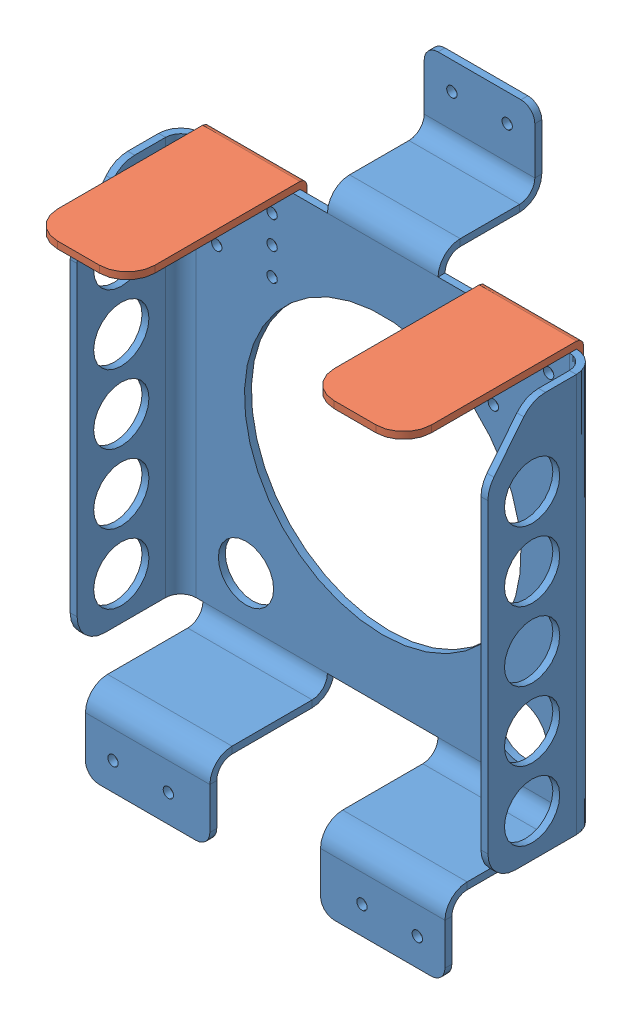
SolidWorks assembly Battery mount with L brackets.SLDASM, configuration Default (file format 9000). Lengths in mm.
Overall size (191.8 270.72 123.82).
3 component instances, 2 part files, 6 mates.
Components (placement in the parent):
- Battery mount horizontal-1: Battery mount horizontal.SLDPRT [Default] at (-114.1968 673.0703 -145.2802) size (191.8 270.72 101.6)
- Battey L Bracket-2: Battey L Bracket.SLDPRT [Default] at (-28.5988 127.1643 -119.8802) x (0 -1 0) z (-1 0 0) size (50.8 82.55 44.7)
- Battey L Bracket-3: Battey L Bracket.SLDPRT [Default] at (98.4012 127.1643 -119.8802) x (0 -1 0) z (-1 0 0) size (50.8 82.55 44.7)
Mates (geometry in assembly coordinates):
- Coincident1: coincident anti-aligned: plane of Battery mount horizontal-1 through (-114.1968 680.9602 -144.4504) normal (0 0 -1); plane of Battey L Bracket-2 through (-200.0488 131.8792 -144.4504) normal (0 0 1)
- Coincident6: coincident anti-aligned: plane of Battery mount horizontal-1 through (-199.9218 131.8792 -141.2754) normal (0 1 0); plane of Battey L Bracket-2 through (-200.0488 131.8792 -65.0754) normal (0 -1 0)
- Coincident7: coincident aligned: circle of Battery mount horizontal-1; circle of Battey L Bracket-2
- Coincident8: coincident: plane of Battery mount horizontal-1 through (-28.4718 123.9893 -196.0802) normal (0 1 0); plane of Battey L Bracket-3 through (-73.0488 123.9893 -119.8802) normal (0 -1 0)
- Coincident9: coincident: plane of Battery mount horizontal-1 through (-114.1968 673.0703 -199.2552) normal (0 0 -1); plane of Battey L Bracket-3 through (-73.0488 123.9893 -199.2552) normal (0 0 1)
- Coincident10: coincident aligned: circle of Battery mount horizontal-1; circle of Battey L Bracket-3
